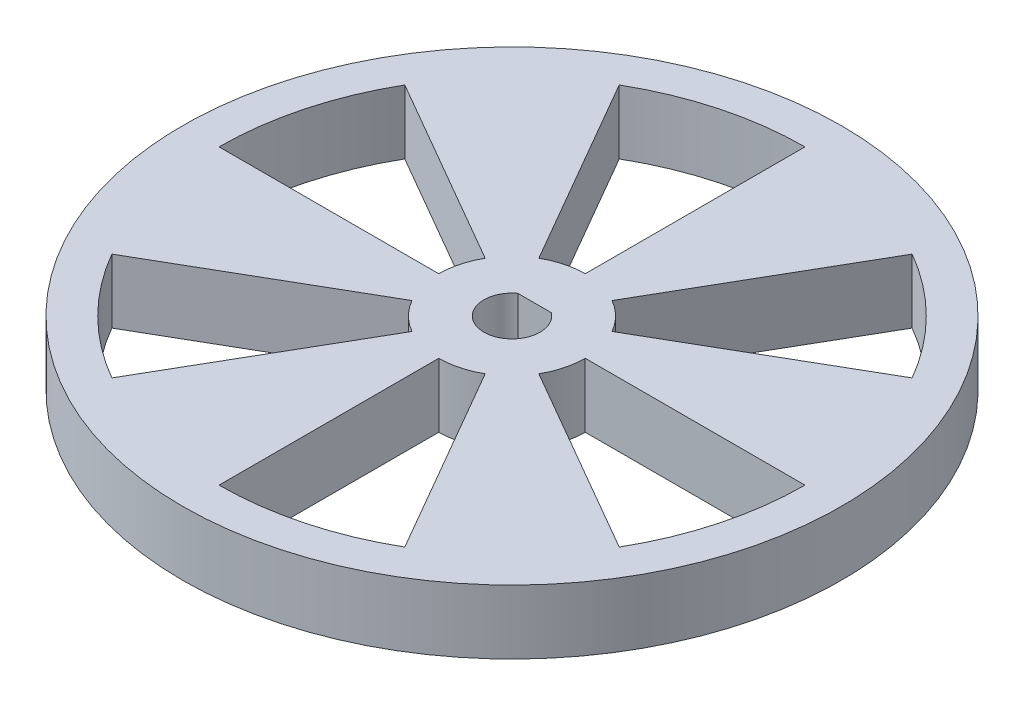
ISO-10303-21;
HEADER;
FILE_DESCRIPTION(('STEP AP214'),'2;1');
FILE_NAME('part.step','',(''),(''),'','','');
FILE_SCHEMA(('AUTOMOTIVE_DESIGN { 1 0 10303 214 1 1 1 1 }'));
ENDSEC;
DATA;
#1=APPLICATION_CONTEXT('core data for automotive mechanical design processes');
#2=APPLICATION_PROTOCOL_DEFINITION('international standard','automotive_design',2000,#1);
#3=PRODUCT_CONTEXT('',#1,'mechanical');
#4=PRODUCT('Part','Part','',(#3));
#5=PRODUCT_RELATED_PRODUCT_CATEGORY('part','',(#4));
#6=PRODUCT_DEFINITION_FORMATION('','',#4);
#7=PRODUCT_DEFINITION_CONTEXT('part definition',#1,'design');
#8=PRODUCT_DEFINITION('design','',#6,#7);
#9=PRODUCT_DEFINITION_SHAPE('','',#8);
#10=(LENGTH_UNIT() NAMED_UNIT(*) SI_UNIT(.MILLI.,.METRE.));
#11=(NAMED_UNIT(*) PLANE_ANGLE_UNIT() SI_UNIT($,.RADIAN.));
#12=(NAMED_UNIT(*) SI_UNIT($,.STERADIAN.) SOLID_ANGLE_UNIT());
#13=UNCERTAINTY_MEASURE_WITH_UNIT(LENGTH_MEASURE(1.E-05),#10,'distance_accuracy_value','');
#14=(GEOMETRIC_REPRESENTATION_CONTEXT(3) GLOBAL_UNCERTAINTY_ASSIGNED_CONTEXT((#13)) GLOBAL_UNIT_ASSIGNED_CONTEXT((#10,
#11,#12)) REPRESENTATION_CONTEXT('',''));
#15=CARTESIAN_POINT('',(0.,0.,0.));
#16=DIRECTION('',(0.,0.,1.));
#17=DIRECTION('',(1.,0.,0.));
#18=AXIS2_PLACEMENT_3D('',#15,#16,#17);
#19=CARTESIAN_POINT('',(0.,7.,0.));
#20=DIRECTION('',(0.,1.,0.));
#21=DIRECTION('',(0.,0.,1.));
#22=AXIS2_PLACEMENT_3D('',#19,#20,#21);
#23=PLANE('',#22);
#24=DIRECTION('',(-0.499999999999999,0.,0.866025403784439));
#25=VECTOR('',#24,1.);
#26=CARTESIAN_POINT('',(4.,7.,-6.92820323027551));
#27=LINE('',#26,#25);
#28=CARTESIAN_POINT('',(16.,7.,-27.712812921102));
#29=VERTEX_POINT('',#28);
#30=CARTESIAN_POINT('',(4.,7.,-6.92820323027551));
#31=VERTEX_POINT('',#30);
#32=EDGE_CURVE('E242',#29,#31,#27,.T.);
#33=ORIENTED_EDGE('',*,*,#32,.F.);
#34=CARTESIAN_POINT('',(0.,7.,0.));
#35=DIRECTION('',(0.,1.,0.));
#36=DIRECTION('',(0.,0.,1.));
#37=AXIS2_PLACEMENT_3D('',#34,#35,#36);
#38=CIRCLE('',#37,32.);
#39=CARTESIAN_POINT('',(27.712812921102,7.,-16.));
#40=VERTEX_POINT('',#39);
#41=EDGE_CURVE('E240',#40,#29,#38,.T.);
#42=ORIENTED_EDGE('',*,*,#41,.F.);
#43=DIRECTION('',(0.866025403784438,0.,-0.500000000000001));
#44=VECTOR('',#43,1.);
#45=CARTESIAN_POINT('',(6.92820323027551,7.,-4.));
#46=LINE('',#45,#44);
#47=CARTESIAN_POINT('',(6.92820323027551,7.,-4.00000000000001));
#48=VERTEX_POINT('',#47);
#49=EDGE_CURVE('E248',#48,#40,#46,.T.);
#50=ORIENTED_EDGE('',*,*,#49,.F.);
#51=CARTESIAN_POINT('',(0.,7.,0.));
#52=DIRECTION('',(0.,-1.,0.));
#53=DIRECTION('',(0.,0.,1.));
#54=AXIS2_PLACEMENT_3D('',#51,#52,#53);
#55=CIRCLE('',#54,8.);
#56=EDGE_CURVE('E245',#31,#48,#55,.T.);
#57=ORIENTED_EDGE('',*,*,#56,.F.);
#58=EDGE_LOOP('',(#33,#42,#50,#57));
#59=FACE_BOUND('',#58,.T.);
#60=DIRECTION('',(-1.,0.,0.));
#61=VECTOR('',#60,1.);
#62=CARTESIAN_POINT('',(1.83187666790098,7.,-2.46356));
#63=LINE('',#62,#61);
#64=CARTESIAN_POINT('',(1.83187666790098,7.,-2.46356));
#65=VERTEX_POINT('',#64);
#66=CARTESIAN_POINT('',(-1.83187666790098,7.,-2.46356));
#67=VERTEX_POINT('',#66);
#68=EDGE_CURVE('E305',#65,#67,#63,.T.);
#69=ORIENTED_EDGE('',*,*,#68,.F.);
#70=CARTESIAN_POINT('',(0.,7.,0.));
#71=DIRECTION('',(0.,1.,0.));
#72=DIRECTION('',(0.,0.,1.));
#73=AXIS2_PLACEMENT_3D('',#70,#71,#72);
#74=CIRCLE('',#73,3.07);
#75=EDGE_CURVE('E302',#67,#65,#74,.T.);
#76=ORIENTED_EDGE('',*,*,#75,.F.);
#77=EDGE_LOOP('',(#69,#76));
#78=FACE_BOUND('',#77,.T.);
#79=DIRECTION('',(0.5,0.,0.866025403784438));
#80=VECTOR('',#79,1.);
#81=CARTESIAN_POINT('',(-4.00000000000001,7.,-6.92820323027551));
#82=LINE('',#81,#80);
#83=CARTESIAN_POINT('',(-16.,7.,-27.712812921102));
#84=VERTEX_POINT('',#83);
#85=CARTESIAN_POINT('',(-4.00000000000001,7.,-6.92820323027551));
#86=VERTEX_POINT('',#85);
#87=EDGE_CURVE('E352',#84,#86,#82,.T.);
#88=ORIENTED_EDGE('',*,*,#87,.F.);
#89=CARTESIAN_POINT('',(0.,7.,0.));
#90=DIRECTION('',(0.,1.,0.));
#91=DIRECTION('',(0.,0.,1.));
#92=AXIS2_PLACEMENT_3D('',#89,#90,#91);
#93=CIRCLE('',#92,32.);
#94=CARTESIAN_POINT('',(2.23523435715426E-13,7.,-32.));
#95=VERTEX_POINT('',#94);
#96=EDGE_CURVE('E350',#95,#84,#93,.T.);
#97=ORIENTED_EDGE('',*,*,#96,.F.);
#98=DIRECTION('',(0.,0.,-1.));
#99=VECTOR('',#98,1.);
#100=CARTESIAN_POINT('',(0.,7.,-8.));
#101=LINE('',#100,#99);
#102=CARTESIAN_POINT('',(0.,7.,-8.));
#103=VERTEX_POINT('',#102);
#104=EDGE_CURVE('E358',#103,#95,#101,.T.);
#105=ORIENTED_EDGE('',*,*,#104,.F.);
#106=CARTESIAN_POINT('',(0.,7.,0.));
#107=DIRECTION('',(0.,-1.,0.));
#108=DIRECTION('',(0.,0.,1.));
#109=AXIS2_PLACEMENT_3D('',#106,#107,#108);
#110=CIRCLE('',#109,8.);
#111=EDGE_CURVE('E355',#86,#103,#110,.T.);
#112=ORIENTED_EDGE('',*,*,#111,.F.);
#113=EDGE_LOOP('',(#88,#97,#105,#112));
#114=FACE_BOUND('',#113,.T.);
#115=CARTESIAN_POINT('',(0.,7.,0.));
#116=DIRECTION('',(0.,1.,0.));
#117=DIRECTION('',(0.,0.,1.));
#118=AXIS2_PLACEMENT_3D('',#115,#116,#117);
#119=CIRCLE('',#118,36.);
#120=CARTESIAN_POINT('',(0.,7.,36.));
#121=VERTEX_POINT('',#120);
#122=EDGE_CURVE('E11',#121,#121,#119,.T.);
#123=ORIENTED_EDGE('',*,*,#122,.T.);
#124=EDGE_LOOP('',(#123));
#125=FACE_BOUND('',#124,.T.);
#126=DIRECTION('',(-0.866025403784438,0.,0.5));
#127=VECTOR('',#126,1.);
#128=CARTESIAN_POINT('',(-6.92820323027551,7.,4.00000000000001));
#129=LINE('',#128,#127);
#130=CARTESIAN_POINT('',(-6.92820323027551,7.,4.00000000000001));
#131=VERTEX_POINT('',#130);
#132=CARTESIAN_POINT('',(-27.712812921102,7.,16.));
#133=VERTEX_POINT('',#132);
#134=EDGE_CURVE('E383',#131,#133,#129,.T.);
#135=ORIENTED_EDGE('',*,*,#134,.F.);
#136=CARTESIAN_POINT('',(0.,7.,0.));
#137=DIRECTION('',(0.,-1.,0.));
#138=DIRECTION('',(0.,0.,1.));
#139=AXIS2_PLACEMENT_3D('',#136,#137,#138);
#140=CIRCLE('',#139,8.);
#141=CARTESIAN_POINT('',(-4.,7.,6.92820323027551));
#142=VERTEX_POINT('',#141);
#143=EDGE_CURVE('E381',#142,#131,#140,.T.);
#144=ORIENTED_EDGE('',*,*,#143,.F.);
#145=DIRECTION('',(0.5,0.,-0.866025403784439));
#146=VECTOR('',#145,1.);
#147=CARTESIAN_POINT('',(-4.,7.,6.92820323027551));
#148=LINE('',#147,#146);
#149=CARTESIAN_POINT('',(-16.,7.,27.712812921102));
#150=VERTEX_POINT('',#149);
#151=EDGE_CURVE('E389',#150,#142,#148,.T.);
#152=ORIENTED_EDGE('',*,*,#151,.F.);
#153=CARTESIAN_POINT('',(0.,7.,0.));
#154=DIRECTION('',(0.,1.,0.));
#155=DIRECTION('',(0.,0.,1.));
#156=AXIS2_PLACEMENT_3D('',#153,#154,#155);
#157=CIRCLE('',#156,32.);
#158=EDGE_CURVE('E386',#133,#150,#157,.T.);
#159=ORIENTED_EDGE('',*,*,#158,.F.);
#160=EDGE_LOOP('',(#135,#144,#152,#159));
#161=FACE_BOUND('',#160,.T.);
#162=DIRECTION('',(-0.5,0.,-0.866025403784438));
#163=VECTOR('',#162,1.);
#164=CARTESIAN_POINT('',(4.,7.,6.92820323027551));
#165=LINE('',#164,#163);
#166=CARTESIAN_POINT('',(16.,7.,27.712812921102));
#167=VERTEX_POINT('',#166);
#168=CARTESIAN_POINT('',(4.,7.,6.92820323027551));
#169=VERTEX_POINT('',#168);
#170=EDGE_CURVE('E321',#167,#169,#165,.T.);
#171=ORIENTED_EDGE('',*,*,#170,.F.);
#172=CARTESIAN_POINT('',(0.,7.,0.));
#173=DIRECTION('',(0.,1.,0.));
#174=DIRECTION('',(0.,0.,1.));
#175=AXIS2_PLACEMENT_3D('',#172,#173,#174);
#176=CIRCLE('',#175,32.);
#177=CARTESIAN_POINT('',(0.,7.,32.));
#178=VERTEX_POINT('',#177);
#179=EDGE_CURVE('E319',#178,#167,#176,.T.);
#180=ORIENTED_EDGE('',*,*,#179,.F.);
#181=DIRECTION('',(0.,0.,1.));
#182=VECTOR('',#181,1.);
#183=CARTESIAN_POINT('',(0.,7.,8.));
#184=LINE('',#183,#182);
#185=CARTESIAN_POINT('',(0.,7.,8.));
#186=VERTEX_POINT('',#185);
#187=EDGE_CURVE('E327',#186,#178,#184,.T.);
#188=ORIENTED_EDGE('',*,*,#187,.F.);
#189=CARTESIAN_POINT('',(0.,7.,0.));
#190=DIRECTION('',(0.,-1.,0.));
#191=DIRECTION('',(0.,0.,1.));
#192=AXIS2_PLACEMENT_3D('',#189,#190,#191);
#193=CIRCLE('',#192,8.);
#194=EDGE_CURVE('E324',#169,#186,#193,.T.);
#195=ORIENTED_EDGE('',*,*,#194,.F.);
#196=EDGE_LOOP('',(#171,#180,#188,#195));
#197=FACE_BOUND('',#196,.T.);
#198=DIRECTION('',(1.,0.,0.));
#199=VECTOR('',#198,1.);
#200=CARTESIAN_POINT('',(-8.,7.,0.));
#201=LINE('',#200,#199);
#202=CARTESIAN_POINT('',(-32.,7.,-1.11795968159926E-13));
#203=VERTEX_POINT('',#202);
#204=CARTESIAN_POINT('',(-8.,7.,0.));
#205=VERTEX_POINT('',#204);
#206=EDGE_CURVE('E273',#203,#205,#201,.T.);
#207=ORIENTED_EDGE('',*,*,#206,.F.);
#208=CARTESIAN_POINT('',(0.,7.,0.));
#209=DIRECTION('',(0.,1.,0.));
#210=DIRECTION('',(0.,0.,1.));
#211=AXIS2_PLACEMENT_3D('',#208,#209,#210);
#212=CIRCLE('',#211,32.);
#213=CARTESIAN_POINT('',(-27.712812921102,7.,-16.));
#214=VERTEX_POINT('',#213);
#215=EDGE_CURVE('E271',#214,#203,#212,.T.);
#216=ORIENTED_EDGE('',*,*,#215,.F.);
#217=DIRECTION('',(-0.866025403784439,0.,-0.499999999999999));
#218=VECTOR('',#217,1.);
#219=CARTESIAN_POINT('',(-6.92820323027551,7.,-3.99999999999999));
#220=LINE('',#219,#218);
#221=CARTESIAN_POINT('',(-6.92820323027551,7.,-3.99999999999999));
#222=VERTEX_POINT('',#221);
#223=EDGE_CURVE('E279',#222,#214,#220,.T.);
#224=ORIENTED_EDGE('',*,*,#223,.F.);
#225=CARTESIAN_POINT('',(0.,7.,0.));
#226=DIRECTION('',(0.,-1.,0.));
#227=DIRECTION('',(0.,0.,1.));
#228=AXIS2_PLACEMENT_3D('',#225,#226,#227);
#229=CIRCLE('',#228,8.);
#230=EDGE_CURVE('E276',#205,#222,#229,.T.);
#231=ORIENTED_EDGE('',*,*,#230,.F.);
#232=EDGE_LOOP('',(#207,#216,#224,#231));
#233=FACE_BOUND('',#232,.T.);
#234=DIRECTION('',(0.866025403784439,0.,0.5));
#235=VECTOR('',#234,1.);
#236=CARTESIAN_POINT('',(6.92820323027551,7.,4.));
#237=LINE('',#236,#235);
#238=CARTESIAN_POINT('',(6.92820323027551,7.,4.));
#239=VERTEX_POINT('',#238);
#240=CARTESIAN_POINT('',(27.712812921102,7.,16.));
#241=VERTEX_POINT('',#240);
#242=EDGE_CURVE('E212',#239,#241,#237,.T.);
#243=ORIENTED_EDGE('',*,*,#242,.F.);
#244=CARTESIAN_POINT('',(0.,7.,0.));
#245=DIRECTION('',(0.,-1.,0.));
#246=DIRECTION('',(0.,0.,1.));
#247=AXIS2_PLACEMENT_3D('',#244,#245,#246);
#248=CIRCLE('',#247,8.);
#249=CARTESIAN_POINT('',(8.,7.,0.));
#250=VERTEX_POINT('',#249);
#251=EDGE_CURVE('E204',#250,#239,#248,.T.);
#252=ORIENTED_EDGE('',*,*,#251,.F.);
#253=DIRECTION('',(-1.,0.,0.));
#254=VECTOR('',#253,1.);
#255=CARTESIAN_POINT('',(8.,7.,0.));
#256=LINE('',#255,#254);
#257=CARTESIAN_POINT('',(32.,7.,3.35250903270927E-13));
#258=VERTEX_POINT('',#257);
#259=EDGE_CURVE('E226',#258,#250,#256,.T.);
#260=ORIENTED_EDGE('',*,*,#259,.F.);
#261=CARTESIAN_POINT('',(0.,7.,0.));
#262=DIRECTION('',(0.,1.,0.));
#263=DIRECTION('',(0.,0.,1.));
#264=AXIS2_PLACEMENT_3D('',#261,#262,#263);
#265=CIRCLE('',#264,32.);
#266=EDGE_CURVE('E224',#241,#258,#265,.T.);
#267=ORIENTED_EDGE('',*,*,#266,.F.);
#268=EDGE_LOOP('',(#243,#252,#260,#267));
#269=FACE_BOUND('',#268,.T.);
#270=ADVANCED_FACE('F31',(#59,#78,#114,#125,#161,#197,#233,#269),#23,.T.);
#271=CARTESIAN_POINT('',(0.,0.,0.));
#272=DIRECTION('',(0.,1.,0.));
#273=DIRECTION('',(0.,0.,1.));
#274=AXIS2_PLACEMENT_3D('',#271,#272,#273);
#275=PLANE('',#274);
#276=CARTESIAN_POINT('',(0.,0.,0.));
#277=DIRECTION('',(0.,1.,0.));
#278=DIRECTION('',(0.,0.,1.));
#279=AXIS2_PLACEMENT_3D('',#276,#277,#278);
#280=CIRCLE('',#279,32.);
#281=CARTESIAN_POINT('',(27.712812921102,0.,-16.));
#282=VERTEX_POINT('',#281);
#283=CARTESIAN_POINT('',(16.,0.,-27.712812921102));
#284=VERTEX_POINT('',#283);
#285=EDGE_CURVE('E220',#282,#284,#280,.T.);
#286=ORIENTED_EDGE('',*,*,#285,.T.);
#287=DIRECTION('',(-0.499999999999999,0.,0.866025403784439));
#288=VECTOR('',#287,1.);
#289=CARTESIAN_POINT('',(4.,0.,-6.92820323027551));
#290=LINE('',#289,#288);
#291=CARTESIAN_POINT('',(4.,0.,-6.92820323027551));
#292=VERTEX_POINT('',#291);
#293=EDGE_CURVE('E253',#284,#292,#290,.T.);
#294=ORIENTED_EDGE('',*,*,#293,.T.);
#295=CARTESIAN_POINT('',(0.,0.,0.));
#296=DIRECTION('',(0.,-1.,0.));
#297=DIRECTION('',(0.,0.,1.));
#298=AXIS2_PLACEMENT_3D('',#295,#296,#297);
#299=CIRCLE('',#298,8.);
#300=CARTESIAN_POINT('',(6.92820323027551,0.,-4.));
#301=VERTEX_POINT('',#300);
#302=EDGE_CURVE('E256',#292,#301,#299,.T.);
#303=ORIENTED_EDGE('',*,*,#302,.T.);
#304=DIRECTION('',(0.866025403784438,0.,-0.500000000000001));
#305=VECTOR('',#304,1.);
#306=CARTESIAN_POINT('',(6.92820323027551,0.,-4.));
#307=LINE('',#306,#305);
#308=EDGE_CURVE('E243',#301,#282,#307,.T.);
#309=ORIENTED_EDGE('',*,*,#308,.T.);
#310=EDGE_LOOP('',(#286,#294,#303,#309));
#311=FACE_BOUND('',#310,.T.);
#312=CARTESIAN_POINT('',(0.,0.,0.));
#313=DIRECTION('',(0.,1.,0.));
#314=DIRECTION('',(0.,0.,1.));
#315=AXIS2_PLACEMENT_3D('',#312,#313,#314);
#316=CIRCLE('',#315,3.07);
#317=CARTESIAN_POINT('',(-1.83187666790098,0.,-2.46356));
#318=VERTEX_POINT('',#317);
#319=CARTESIAN_POINT('',(1.83187666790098,0.,-2.46356));
#320=VERTEX_POINT('',#319);
#321=EDGE_CURVE('E301',#318,#320,#316,.T.);
#322=ORIENTED_EDGE('',*,*,#321,.T.);
#323=DIRECTION('',(-1.,0.,0.));
#324=VECTOR('',#323,1.);
#325=CARTESIAN_POINT('',(1.83187666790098,0.,-2.46356));
#326=LINE('',#325,#324);
#327=EDGE_CURVE('E306',#320,#318,#326,.T.);
#328=ORIENTED_EDGE('',*,*,#327,.T.);
#329=EDGE_LOOP('',(#322,#328));
#330=FACE_BOUND('',#329,.T.);
#331=CARTESIAN_POINT('',(0.,0.,0.));
#332=DIRECTION('',(0.,1.,0.));
#333=DIRECTION('',(0.,0.,1.));
#334=AXIS2_PLACEMENT_3D('',#331,#332,#333);
#335=CIRCLE('',#334,32.);
#336=CARTESIAN_POINT('',(2.23523435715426E-13,0.,-32.));
#337=VERTEX_POINT('',#336);
#338=CARTESIAN_POINT('',(-16.,0.,-27.712812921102));
#339=VERTEX_POINT('',#338);
#340=EDGE_CURVE('E349',#337,#339,#335,.T.);
#341=ORIENTED_EDGE('',*,*,#340,.T.);
#342=DIRECTION('',(0.5,0.,0.866025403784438));
#343=VECTOR('',#342,1.);
#344=CARTESIAN_POINT('',(-4.00000000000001,0.,-6.92820323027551));
#345=LINE('',#344,#343);
#346=CARTESIAN_POINT('',(-4.00000000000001,0.,-6.92820323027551));
#347=VERTEX_POINT('',#346);
#348=EDGE_CURVE('E363',#339,#347,#345,.T.);
#349=ORIENTED_EDGE('',*,*,#348,.T.);
#350=CARTESIAN_POINT('',(0.,0.,0.));
#351=DIRECTION('',(0.,-1.,0.));
#352=DIRECTION('',(0.,0.,1.));
#353=AXIS2_PLACEMENT_3D('',#350,#351,#352);
#354=CIRCLE('',#353,8.);
#355=CARTESIAN_POINT('',(0.,0.,-8.));
#356=VERTEX_POINT('',#355);
#357=EDGE_CURVE('E366',#347,#356,#354,.T.);
#358=ORIENTED_EDGE('',*,*,#357,.T.);
#359=DIRECTION('',(0.,0.,-1.));
#360=VECTOR('',#359,1.);
#361=CARTESIAN_POINT('',(0.,0.,-8.));
#362=LINE('',#361,#360);
#363=EDGE_CURVE('E353',#356,#337,#362,.T.);
#364=ORIENTED_EDGE('',*,*,#363,.T.);
#365=EDGE_LOOP('',(#341,#349,#358,#364));
#366=FACE_BOUND('',#365,.T.);
#367=CARTESIAN_POINT('',(0.,0.,0.));
#368=DIRECTION('',(0.,1.,0.));
#369=DIRECTION('',(0.,0.,1.));
#370=AXIS2_PLACEMENT_3D('',#367,#368,#369);
#371=CIRCLE('',#370,36.);
#372=CARTESIAN_POINT('',(0.,0.,36.));
#373=VERTEX_POINT('',#372);
#374=EDGE_CURVE('E35',#373,#373,#371,.T.);
#375=ORIENTED_EDGE('',*,*,#374,.F.);
#376=EDGE_LOOP('',(#375));
#377=FACE_BOUND('',#376,.T.);
#378=CARTESIAN_POINT('',(0.,0.,0.));
#379=DIRECTION('',(0.,-1.,0.));
#380=DIRECTION('',(0.,0.,1.));
#381=AXIS2_PLACEMENT_3D('',#378,#379,#380);
#382=CIRCLE('',#381,8.);
#383=CARTESIAN_POINT('',(-4.,0.,6.92820323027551));
#384=VERTEX_POINT('',#383);
#385=CARTESIAN_POINT('',(-6.92820323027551,0.,4.00000000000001));
#386=VERTEX_POINT('',#385);
#387=EDGE_CURVE('E380',#384,#386,#382,.T.);
#388=ORIENTED_EDGE('',*,*,#387,.T.);
#389=DIRECTION('',(-0.866025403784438,0.,0.5));
#390=VECTOR('',#389,1.);
#391=CARTESIAN_POINT('',(-6.92820323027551,0.,4.00000000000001));
#392=LINE('',#391,#390);
#393=CARTESIAN_POINT('',(-27.712812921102,0.,16.));
#394=VERTEX_POINT('',#393);
#395=EDGE_CURVE('E394',#386,#394,#392,.T.);
#396=ORIENTED_EDGE('',*,*,#395,.T.);
#397=CARTESIAN_POINT('',(0.,0.,0.));
#398=DIRECTION('',(0.,1.,0.));
#399=DIRECTION('',(0.,0.,1.));
#400=AXIS2_PLACEMENT_3D('',#397,#398,#399);
#401=CIRCLE('',#400,32.);
#402=CARTESIAN_POINT('',(-16.,0.,27.712812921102));
#403=VERTEX_POINT('',#402);
#404=EDGE_CURVE('E397',#394,#403,#401,.T.);
#405=ORIENTED_EDGE('',*,*,#404,.T.);
#406=DIRECTION('',(0.5,0.,-0.866025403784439));
#407=VECTOR('',#406,1.);
#408=CARTESIAN_POINT('',(-4.,0.,6.92820323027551));
#409=LINE('',#408,#407);
#410=EDGE_CURVE('E384',#403,#384,#409,.T.);
#411=ORIENTED_EDGE('',*,*,#410,.T.);
#412=EDGE_LOOP('',(#388,#396,#405,#411));
#413=FACE_BOUND('',#412,.T.);
#414=CARTESIAN_POINT('',(0.,0.,0.));
#415=DIRECTION('',(0.,1.,0.));
#416=DIRECTION('',(0.,0.,1.));
#417=AXIS2_PLACEMENT_3D('',#414,#415,#416);
#418=CIRCLE('',#417,32.);
#419=CARTESIAN_POINT('',(0.,0.,32.));
#420=VERTEX_POINT('',#419);
#421=CARTESIAN_POINT('',(16.,0.,27.712812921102));
#422=VERTEX_POINT('',#421);
#423=EDGE_CURVE('E318',#420,#422,#418,.T.);
#424=ORIENTED_EDGE('',*,*,#423,.T.);
#425=DIRECTION('',(-0.5,0.,-0.866025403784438));
#426=VECTOR('',#425,1.);
#427=CARTESIAN_POINT('',(4.,0.,6.92820323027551));
#428=LINE('',#427,#426);
#429=CARTESIAN_POINT('',(4.,0.,6.92820323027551));
#430=VERTEX_POINT('',#429);
#431=EDGE_CURVE('E332',#422,#430,#428,.T.);
#432=ORIENTED_EDGE('',*,*,#431,.T.);
#433=CARTESIAN_POINT('',(0.,0.,0.));
#434=DIRECTION('',(0.,-1.,0.));
#435=DIRECTION('',(0.,0.,1.));
#436=AXIS2_PLACEMENT_3D('',#433,#434,#435);
#437=CIRCLE('',#436,8.);
#438=CARTESIAN_POINT('',(0.,0.,8.));
#439=VERTEX_POINT('',#438);
#440=EDGE_CURVE('E335',#430,#439,#437,.T.);
#441=ORIENTED_EDGE('',*,*,#440,.T.);
#442=DIRECTION('',(0.,0.,1.));
#443=VECTOR('',#442,1.);
#444=CARTESIAN_POINT('',(0.,0.,8.));
#445=LINE('',#444,#443);
#446=EDGE_CURVE('E322',#439,#420,#445,.T.);
#447=ORIENTED_EDGE('',*,*,#446,.T.);
#448=EDGE_LOOP('',(#424,#432,#441,#447));
#449=FACE_BOUND('',#448,.T.);
#450=CARTESIAN_POINT('',(0.,0.,0.));
#451=DIRECTION('',(0.,1.,0.));
#452=DIRECTION('',(0.,0.,1.));
#453=AXIS2_PLACEMENT_3D('',#450,#451,#452);
#454=CIRCLE('',#453,32.);
#455=CARTESIAN_POINT('',(-27.712812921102,0.,-16.));
#456=VERTEX_POINT('',#455);
#457=CARTESIAN_POINT('',(-32.,0.,-1.11795968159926E-13));
#458=VERTEX_POINT('',#457);
#459=EDGE_CURVE('E270',#456,#458,#454,.T.);
#460=ORIENTED_EDGE('',*,*,#459,.T.);
#461=DIRECTION('',(1.,0.,0.));
#462=VECTOR('',#461,1.);
#463=CARTESIAN_POINT('',(-8.,0.,0.));
#464=LINE('',#463,#462);
#465=CARTESIAN_POINT('',(-8.,0.,0.));
#466=VERTEX_POINT('',#465);
#467=EDGE_CURVE('E284',#458,#466,#464,.T.);
#468=ORIENTED_EDGE('',*,*,#467,.T.);
#469=CARTESIAN_POINT('',(0.,0.,0.));
#470=DIRECTION('',(0.,-1.,0.));
#471=DIRECTION('',(0.,0.,1.));
#472=AXIS2_PLACEMENT_3D('',#469,#470,#471);
#473=CIRCLE('',#472,8.);
#474=CARTESIAN_POINT('',(-6.92820323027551,0.,-3.99999999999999));
#475=VERTEX_POINT('',#474);
#476=EDGE_CURVE('E287',#466,#475,#473,.T.);
#477=ORIENTED_EDGE('',*,*,#476,.T.);
#478=DIRECTION('',(-0.866025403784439,0.,-0.499999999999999));
#479=VECTOR('',#478,1.);
#480=CARTESIAN_POINT('',(-6.92820323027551,0.,-3.99999999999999));
#481=LINE('',#480,#479);
#482=EDGE_CURVE('E274',#475,#456,#481,.T.);
#483=ORIENTED_EDGE('',*,*,#482,.T.);
#484=EDGE_LOOP('',(#460,#468,#477,#483));
#485=FACE_BOUND('',#484,.T.);
#486=CARTESIAN_POINT('',(0.,0.,0.));
#487=DIRECTION('',(0.,-1.,0.));
#488=DIRECTION('',(0.,0.,1.));
#489=AXIS2_PLACEMENT_3D('',#486,#487,#488);
#490=CIRCLE('',#489,8.);
#491=CARTESIAN_POINT('',(8.,0.,0.));
#492=VERTEX_POINT('',#491);
#493=CARTESIAN_POINT('',(6.92820323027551,0.,4.));
#494=VERTEX_POINT('',#493);
#495=EDGE_CURVE('E54',#492,#494,#490,.T.);
#496=ORIENTED_EDGE('',*,*,#495,.T.);
#497=DIRECTION('',(0.866025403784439,0.,0.5));
#498=VECTOR('',#497,1.);
#499=CARTESIAN_POINT('',(6.92820323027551,0.,4.));
#500=LINE('',#499,#498);
#501=CARTESIAN_POINT('',(27.712812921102,0.,16.));
#502=VERTEX_POINT('',#501);
#503=EDGE_CURVE('E219',#494,#502,#500,.T.);
#504=ORIENTED_EDGE('',*,*,#503,.T.);
#505=CARTESIAN_POINT('',(0.,0.,0.));
#506=DIRECTION('',(0.,1.,0.));
#507=DIRECTION('',(0.,0.,1.));
#508=AXIS2_PLACEMENT_3D('',#505,#506,#507);
#509=CIRCLE('',#508,32.);
#510=CARTESIAN_POINT('',(32.,0.,3.35250903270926E-13));
#511=VERTEX_POINT('',#510);
#512=EDGE_CURVE('E232',#502,#511,#509,.T.);
#513=ORIENTED_EDGE('',*,*,#512,.T.);
#514=DIRECTION('',(-1.,0.,0.));
#515=VECTOR('',#514,1.);
#516=CARTESIAN_POINT('',(8.,0.,0.));
#517=LINE('',#516,#515);
#518=EDGE_CURVE('E213',#511,#492,#517,.T.);
#519=ORIENTED_EDGE('',*,*,#518,.T.);
#520=EDGE_LOOP('',(#496,#504,#513,#519));
#521=FACE_BOUND('',#520,.T.);
#522=ADVANCED_FACE('F416',(#311,#330,#366,#377,#413,#449,#485,#521),#275,.F.);
#523=CARTESIAN_POINT('',(0.,7.,0.));
#524=DIRECTION('',(0.,-1.,0.));
#525=DIRECTION('',(0.,0.,-1.));
#526=AXIS2_PLACEMENT_3D('',#523,#524,#525);
#527=CYLINDRICAL_SURFACE('',#526,36.);
#528=ORIENTED_EDGE('',*,*,#122,.F.);
#529=EDGE_LOOP('',(#528));
#530=FACE_BOUND('',#529,.T.);
#531=ORIENTED_EDGE('',*,*,#374,.T.);
#532=EDGE_LOOP('',(#531));
#533=FACE_BOUND('',#532,.T.);
#534=ADVANCED_FACE('F33',(#530,#533),#527,.T.);
#535=CARTESIAN_POINT('',(0.,7.,0.));
#536=DIRECTION('',(0.,-1.,0.));
#537=DIRECTION('',(0.,0.,-1.));
#538=AXIS2_PLACEMENT_3D('',#535,#536,#537);
#539=CYLINDRICAL_SURFACE('',#538,8.);
#540=ORIENTED_EDGE('',*,*,#387,.F.);
#541=DIRECTION('',(0.,-1.,0.));
#542=VECTOR('',#541,1.);
#543=CARTESIAN_POINT('',(-4.,7.,6.92820323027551));
#544=LINE('',#543,#542);
#545=EDGE_CURVE('E391',#142,#384,#544,.T.);
#546=ORIENTED_EDGE('',*,*,#545,.F.);
#547=ORIENTED_EDGE('',*,*,#143,.T.);
#548=DIRECTION('',(0.,-1.,0.));
#549=VECTOR('',#548,1.);
#550=CARTESIAN_POINT('',(-6.92820323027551,7.,4.00000000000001));
#551=LINE('',#550,#549);
#552=EDGE_CURVE('E408',#131,#386,#551,.T.);
#553=ORIENTED_EDGE('',*,*,#552,.T.);
#554=EDGE_LOOP('',(#540,#546,#547,#553));
#555=FACE_BOUND('',#554,.T.);
#556=ADVANCED_FACE('F441',(#555),#539,.T.);
#557=CARTESIAN_POINT('',(-6.92820323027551,7.,4.00000000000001));
#558=DIRECTION('',(0.5,0.,0.866025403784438));
#559=DIRECTION('',(0.866025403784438,0.,-0.5));
#560=AXIS2_PLACEMENT_3D('',#557,#558,#559);
#561=PLANE('',#560);
#562=ORIENTED_EDGE('',*,*,#395,.F.);
#563=ORIENTED_EDGE('',*,*,#552,.F.);
#564=ORIENTED_EDGE('',*,*,#134,.T.);
#565=DIRECTION('',(0.,-1.,0.));
#566=VECTOR('',#565,1.);
#567=CARTESIAN_POINT('',(-27.712812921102,7.,16.));
#568=LINE('',#567,#566);
#569=EDGE_CURVE('E406',#133,#394,#568,.T.);
#570=ORIENTED_EDGE('',*,*,#569,.T.);
#571=EDGE_LOOP('',(#562,#563,#564,#570));
#572=FACE_BOUND('',#571,.T.);
#573=ADVANCED_FACE('F444',(#572),#561,.T.);
#574=CARTESIAN_POINT('',(0.,7.,0.));
#575=DIRECTION('',(0.,-1.,0.));
#576=DIRECTION('',(0.,0.,-1.));
#577=AXIS2_PLACEMENT_3D('',#574,#575,#576);
#578=CYLINDRICAL_SURFACE('',#577,32.);
#579=ORIENTED_EDGE('',*,*,#404,.F.);
#580=ORIENTED_EDGE('',*,*,#569,.F.);
#581=ORIENTED_EDGE('',*,*,#158,.T.);
#582=DIRECTION('',(0.,-1.,0.));
#583=VECTOR('',#582,1.);
#584=CARTESIAN_POINT('',(-16.,7.,27.712812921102));
#585=LINE('',#584,#583);
#586=EDGE_CURVE('E404',#150,#403,#585,.T.);
#587=ORIENTED_EDGE('',*,*,#586,.T.);
#588=EDGE_LOOP('',(#579,#580,#581,#587));
#589=FACE_BOUND('',#588,.T.);
#590=ADVANCED_FACE('F447',(#589),#578,.F.);
#591=CARTESIAN_POINT('',(-4.,7.,6.92820323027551));
#592=DIRECTION('',(-0.866025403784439,0.,-0.5));
#593=DIRECTION('',(-0.5,0.,0.866025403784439));
#594=AXIS2_PLACEMENT_3D('',#591,#592,#593);
#595=PLANE('',#594);
#596=ORIENTED_EDGE('',*,*,#410,.F.);
#597=ORIENTED_EDGE('',*,*,#586,.F.);
#598=ORIENTED_EDGE('',*,*,#151,.T.);
#599=ORIENTED_EDGE('',*,*,#545,.T.);
#600=EDGE_LOOP('',(#596,#597,#598,#599));
#601=FACE_BOUND('',#600,.T.);
#602=ADVANCED_FACE('F451',(#601),#595,.T.);
#603=CARTESIAN_POINT('',(0.,7.,0.));
#604=DIRECTION('',(0.,-1.,0.));
#605=DIRECTION('',(0.,0.,-1.));
#606=AXIS2_PLACEMENT_3D('',#603,#604,#605);
#607=CYLINDRICAL_SURFACE('',#606,32.);
#608=ORIENTED_EDGE('',*,*,#340,.F.);
#609=DIRECTION('',(0.,-1.,0.));
#610=VECTOR('',#609,1.);
#611=CARTESIAN_POINT('',(2.23523435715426E-13,7.,-32.));
#612=LINE('',#611,#610);
#613=EDGE_CURVE('E360',#95,#337,#612,.T.);
#614=ORIENTED_EDGE('',*,*,#613,.F.);
#615=ORIENTED_EDGE('',*,*,#96,.T.);
#616=DIRECTION('',(0.,-1.,0.));
#617=VECTOR('',#616,1.);
#618=CARTESIAN_POINT('',(-16.,7.,-27.712812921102));
#619=LINE('',#618,#617);
#620=EDGE_CURVE('E377',#84,#339,#619,.T.);
#621=ORIENTED_EDGE('',*,*,#620,.T.);
#622=EDGE_LOOP('',(#608,#614,#615,#621));
#623=FACE_BOUND('',#622,.T.);
#624=ADVANCED_FACE('F455',(#623),#607,.F.);
#625=CARTESIAN_POINT('',(-4.00000000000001,7.,-6.92820323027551));
#626=DIRECTION('',(0.866025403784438,0.,-0.5));
#627=DIRECTION('',(-0.500000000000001,0.,-0.866025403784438));
#628=AXIS2_PLACEMENT_3D('',#625,#626,#627);
#629=PLANE('',#628);
#630=ORIENTED_EDGE('',*,*,#348,.F.);
#631=ORIENTED_EDGE('',*,*,#620,.F.);
#632=ORIENTED_EDGE('',*,*,#87,.T.);
#633=DIRECTION('',(0.,-1.,0.));
#634=VECTOR('',#633,1.);
#635=CARTESIAN_POINT('',(-4.00000000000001,7.,-6.92820323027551));
#636=LINE('',#635,#634);
#637=EDGE_CURVE('E375',#86,#347,#636,.T.);
#638=ORIENTED_EDGE('',*,*,#637,.T.);
#639=EDGE_LOOP('',(#630,#631,#632,#638));
#640=FACE_BOUND('',#639,.T.);
#641=ADVANCED_FACE('F459',(#640),#629,.T.);
#642=CARTESIAN_POINT('',(0.,7.,0.));
#643=DIRECTION('',(0.,-1.,0.));
#644=DIRECTION('',(0.,0.,-1.));
#645=AXIS2_PLACEMENT_3D('',#642,#643,#644);
#646=CYLINDRICAL_SURFACE('',#645,8.);
#647=ORIENTED_EDGE('',*,*,#357,.F.);
#648=ORIENTED_EDGE('',*,*,#637,.F.);
#649=ORIENTED_EDGE('',*,*,#111,.T.);
#650=DIRECTION('',(0.,-1.,0.));
#651=VECTOR('',#650,1.);
#652=CARTESIAN_POINT('',(0.,7.,-8.));
#653=LINE('',#652,#651);
#654=EDGE_CURVE('E373',#103,#356,#653,.T.);
#655=ORIENTED_EDGE('',*,*,#654,.T.);
#656=EDGE_LOOP('',(#647,#648,#649,#655));
#657=FACE_BOUND('',#656,.T.);
#658=ADVANCED_FACE('F463',(#657),#646,.T.);
#659=CARTESIAN_POINT('',(0.,7.,-8.));
#660=DIRECTION('',(-1.,0.,0.));
#661=DIRECTION('',(0.,0.,1.));
#662=AXIS2_PLACEMENT_3D('',#659,#660,#661);
#663=PLANE('',#662);
#664=ORIENTED_EDGE('',*,*,#363,.F.);
#665=ORIENTED_EDGE('',*,*,#654,.F.);
#666=ORIENTED_EDGE('',*,*,#104,.T.);
#667=ORIENTED_EDGE('',*,*,#613,.T.);
#668=EDGE_LOOP('',(#664,#665,#666,#667));
#669=FACE_BOUND('',#668,.T.);
#670=ADVANCED_FACE('F467',(#669),#663,.T.);
#671=CARTESIAN_POINT('',(0.,7.,0.));
#672=DIRECTION('',(0.,-1.,0.));
#673=DIRECTION('',(0.,0.,-1.));
#674=AXIS2_PLACEMENT_3D('',#671,#672,#673);
#675=CYLINDRICAL_SURFACE('',#674,32.);
#676=ORIENTED_EDGE('',*,*,#423,.F.);
#677=DIRECTION('',(0.,-1.,0.));
#678=VECTOR('',#677,1.);
#679=CARTESIAN_POINT('',(0.,7.,32.));
#680=LINE('',#679,#678);
#681=EDGE_CURVE('E329',#178,#420,#680,.T.);
#682=ORIENTED_EDGE('',*,*,#681,.F.);
#683=ORIENTED_EDGE('',*,*,#179,.T.);
#684=DIRECTION('',(0.,-1.,0.));
#685=VECTOR('',#684,1.);
#686=CARTESIAN_POINT('',(16.,7.,27.712812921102));
#687=LINE('',#686,#685);
#688=EDGE_CURVE('E346',#167,#422,#687,.T.);
#689=ORIENTED_EDGE('',*,*,#688,.T.);
#690=EDGE_LOOP('',(#676,#682,#683,#689));
#691=FACE_BOUND('',#690,.T.);
#692=ADVANCED_FACE('F471',(#691),#675,.F.);
#693=CARTESIAN_POINT('',(4.,7.,6.92820323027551));
#694=DIRECTION('',(-0.866025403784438,0.,0.5));
#695=DIRECTION('',(0.5,0.,0.866025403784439));
#696=AXIS2_PLACEMENT_3D('',#693,#694,#695);
#697=PLANE('',#696);
#698=ORIENTED_EDGE('',*,*,#431,.F.);
#699=ORIENTED_EDGE('',*,*,#688,.F.);
#700=ORIENTED_EDGE('',*,*,#170,.T.);
#701=DIRECTION('',(0.,-1.,0.));
#702=VECTOR('',#701,1.);
#703=CARTESIAN_POINT('',(4.,7.,6.92820323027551));
#704=LINE('',#703,#702);
#705=EDGE_CURVE('E344',#169,#430,#704,.T.);
#706=ORIENTED_EDGE('',*,*,#705,.T.);
#707=EDGE_LOOP('',(#698,#699,#700,#706));
#708=FACE_BOUND('',#707,.T.);
#709=ADVANCED_FACE('F475',(#708),#697,.T.);
#710=CARTESIAN_POINT('',(0.,7.,0.));
#711=DIRECTION('',(0.,-1.,0.));
#712=DIRECTION('',(0.,0.,-1.));
#713=AXIS2_PLACEMENT_3D('',#710,#711,#712);
#714=CYLINDRICAL_SURFACE('',#713,8.);
#715=ORIENTED_EDGE('',*,*,#440,.F.);
#716=ORIENTED_EDGE('',*,*,#705,.F.);
#717=ORIENTED_EDGE('',*,*,#194,.T.);
#718=DIRECTION('',(0.,-1.,0.));
#719=VECTOR('',#718,1.);
#720=CARTESIAN_POINT('',(0.,7.,8.));
#721=LINE('',#720,#719);
#722=EDGE_CURVE('E342',#186,#439,#721,.T.);
#723=ORIENTED_EDGE('',*,*,#722,.T.);
#724=EDGE_LOOP('',(#715,#716,#717,#723));
#725=FACE_BOUND('',#724,.T.);
#726=ADVANCED_FACE('F479',(#725),#714,.T.);
#727=CARTESIAN_POINT('',(0.,7.,8.));
#728=DIRECTION('',(1.,0.,0.));
#729=DIRECTION('',(0.,0.,-1.));
#730=AXIS2_PLACEMENT_3D('',#727,#728,#729);
#731=PLANE('',#730);
#732=ORIENTED_EDGE('',*,*,#446,.F.);
#733=ORIENTED_EDGE('',*,*,#722,.F.);
#734=ORIENTED_EDGE('',*,*,#187,.T.);
#735=ORIENTED_EDGE('',*,*,#681,.T.);
#736=EDGE_LOOP('',(#732,#733,#734,#735));
#737=FACE_BOUND('',#736,.T.);
#738=ADVANCED_FACE('F483',(#737),#731,.T.);
#739=CARTESIAN_POINT('',(0.,7.,0.));
#740=DIRECTION('',(0.,-1.,0.));
#741=DIRECTION('',(0.,0.,-1.));
#742=AXIS2_PLACEMENT_3D('',#739,#740,#741);
#743=CYLINDRICAL_SURFACE('',#742,3.07);
#744=ORIENTED_EDGE('',*,*,#321,.F.);
#745=DIRECTION('',(0.,-1.,0.));
#746=VECTOR('',#745,1.);
#747=CARTESIAN_POINT('',(-1.83187666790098,7.,-2.46356));
#748=LINE('',#747,#746);
#749=EDGE_CURVE('E308',#67,#318,#748,.T.);
#750=ORIENTED_EDGE('',*,*,#749,.F.);
#751=ORIENTED_EDGE('',*,*,#75,.T.);
#752=DIRECTION('',(0.,-1.,0.));
#753=VECTOR('',#752,1.);
#754=CARTESIAN_POINT('',(1.83187666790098,7.,-2.46356));
#755=LINE('',#754,#753);
#756=EDGE_CURVE('E315',#65,#320,#755,.T.);
#757=ORIENTED_EDGE('',*,*,#756,.T.);
#758=EDGE_LOOP('',(#744,#750,#751,#757));
#759=FACE_BOUND('',#758,.T.);
#760=ADVANCED_FACE('F487',(#759),#743,.F.);
#761=CARTESIAN_POINT('',(1.83187666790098,7.,-2.46356));
#762=DIRECTION('',(0.,0.,1.));
#763=DIRECTION('',(1.,0.,0.));
#764=AXIS2_PLACEMENT_3D('',#761,#762,#763);
#765=PLANE('',#764);
#766=ORIENTED_EDGE('',*,*,#327,.F.);
#767=ORIENTED_EDGE('',*,*,#756,.F.);
#768=ORIENTED_EDGE('',*,*,#68,.T.);
#769=ORIENTED_EDGE('',*,*,#749,.T.);
#770=EDGE_LOOP('',(#766,#767,#768,#769));
#771=FACE_BOUND('',#770,.T.);
#772=ADVANCED_FACE('F491',(#771),#765,.T.);
#773=CARTESIAN_POINT('',(0.,7.,0.));
#774=DIRECTION('',(0.,-1.,0.));
#775=DIRECTION('',(0.,0.,-1.));
#776=AXIS2_PLACEMENT_3D('',#773,#774,#775);
#777=CYLINDRICAL_SURFACE('',#776,32.);
#778=ORIENTED_EDGE('',*,*,#459,.F.);
#779=DIRECTION('',(0.,-1.,0.));
#780=VECTOR('',#779,1.);
#781=CARTESIAN_POINT('',(-27.712812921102,7.,-16.));
#782=LINE('',#781,#780);
#783=EDGE_CURVE('E281',#214,#456,#782,.T.);
#784=ORIENTED_EDGE('',*,*,#783,.F.);
#785=ORIENTED_EDGE('',*,*,#215,.T.);
#786=DIRECTION('',(0.,-1.,0.));
#787=VECTOR('',#786,1.);
#788=CARTESIAN_POINT('',(-32.,7.,-1.11795968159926E-13));
#789=LINE('',#788,#787);
#790=EDGE_CURVE('E298',#203,#458,#789,.T.);
#791=ORIENTED_EDGE('',*,*,#790,.T.);
#792=EDGE_LOOP('',(#778,#784,#785,#791));
#793=FACE_BOUND('',#792,.T.);
#794=ADVANCED_FACE('F495',(#793),#777,.F.);
#795=CARTESIAN_POINT('',(-8.,7.,0.));
#796=DIRECTION('',(0.,0.,-1.));
#797=DIRECTION('',(-1.,0.,0.));
#798=AXIS2_PLACEMENT_3D('',#795,#796,#797);
#799=PLANE('',#798);
#800=ORIENTED_EDGE('',*,*,#467,.F.);
#801=ORIENTED_EDGE('',*,*,#790,.F.);
#802=ORIENTED_EDGE('',*,*,#206,.T.);
#803=DIRECTION('',(0.,-1.,0.));
#804=VECTOR('',#803,1.);
#805=CARTESIAN_POINT('',(-8.,7.,0.));
#806=LINE('',#805,#804);
#807=EDGE_CURVE('E296',#205,#466,#806,.T.);
#808=ORIENTED_EDGE('',*,*,#807,.T.);
#809=EDGE_LOOP('',(#800,#801,#802,#808));
#810=FACE_BOUND('',#809,.T.);
#811=ADVANCED_FACE('F499',(#810),#799,.T.);
#812=CARTESIAN_POINT('',(0.,7.,0.));
#813=DIRECTION('',(0.,-1.,0.));
#814=DIRECTION('',(0.,0.,-1.));
#815=AXIS2_PLACEMENT_3D('',#812,#813,#814);
#816=CYLINDRICAL_SURFACE('',#815,8.);
#817=ORIENTED_EDGE('',*,*,#476,.F.);
#818=ORIENTED_EDGE('',*,*,#807,.F.);
#819=ORIENTED_EDGE('',*,*,#230,.T.);
#820=DIRECTION('',(0.,-1.,0.));
#821=VECTOR('',#820,1.);
#822=CARTESIAN_POINT('',(-6.92820323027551,7.,-3.99999999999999));
#823=LINE('',#822,#821);
#824=EDGE_CURVE('E294',#222,#475,#823,.T.);
#825=ORIENTED_EDGE('',*,*,#824,.T.);
#826=EDGE_LOOP('',(#817,#818,#819,#825));
#827=FACE_BOUND('',#826,.T.);
#828=ADVANCED_FACE('F503',(#827),#816,.T.);
#829=CARTESIAN_POINT('',(-6.92820323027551,7.,-3.99999999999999));
#830=DIRECTION('',(-0.499999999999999,0.,0.866025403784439));
#831=DIRECTION('',(0.866025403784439,0.,0.5));
#832=AXIS2_PLACEMENT_3D('',#829,#830,#831);
#833=PLANE('',#832);
#834=ORIENTED_EDGE('',*,*,#482,.F.);
#835=ORIENTED_EDGE('',*,*,#824,.F.);
#836=ORIENTED_EDGE('',*,*,#223,.T.);
#837=ORIENTED_EDGE('',*,*,#783,.T.);
#838=EDGE_LOOP('',(#834,#835,#836,#837));
#839=FACE_BOUND('',#838,.T.);
#840=ADVANCED_FACE('F507',(#839),#833,.T.);
#841=CARTESIAN_POINT('',(0.,7.,0.));
#842=DIRECTION('',(0.,-1.,0.));
#843=DIRECTION('',(0.,0.,-1.));
#844=AXIS2_PLACEMENT_3D('',#841,#842,#843);
#845=CYLINDRICAL_SURFACE('',#844,32.);
#846=ORIENTED_EDGE('',*,*,#285,.F.);
#847=DIRECTION('',(0.,-1.,0.));
#848=VECTOR('',#847,1.);
#849=CARTESIAN_POINT('',(27.712812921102,7.,-16.));
#850=LINE('',#849,#848);
#851=EDGE_CURVE('E250',#40,#282,#850,.T.);
#852=ORIENTED_EDGE('',*,*,#851,.F.);
#853=ORIENTED_EDGE('',*,*,#41,.T.);
#854=DIRECTION('',(0.,-1.,0.));
#855=VECTOR('',#854,1.);
#856=CARTESIAN_POINT('',(16.,7.,-27.712812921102));
#857=LINE('',#856,#855);
#858=EDGE_CURVE('E267',#29,#284,#857,.T.);
#859=ORIENTED_EDGE('',*,*,#858,.T.);
#860=EDGE_LOOP('',(#846,#852,#853,#859));
#861=FACE_BOUND('',#860,.T.);
#862=ADVANCED_FACE('F511',(#861),#845,.F.);
#863=CARTESIAN_POINT('',(4.,7.,-6.92820323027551));
#864=DIRECTION('',(0.866025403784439,0.,0.499999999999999));
#865=DIRECTION('',(0.499999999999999,0.,-0.866025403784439));
#866=AXIS2_PLACEMENT_3D('',#863,#864,#865);
#867=PLANE('',#866);
#868=ORIENTED_EDGE('',*,*,#293,.F.);
#869=ORIENTED_EDGE('',*,*,#858,.F.);
#870=ORIENTED_EDGE('',*,*,#32,.T.);
#871=DIRECTION('',(0.,-1.,0.));
#872=VECTOR('',#871,1.);
#873=CARTESIAN_POINT('',(4.,7.,-6.92820323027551));
#874=LINE('',#873,#872);
#875=EDGE_CURVE('E265',#31,#292,#874,.T.);
#876=ORIENTED_EDGE('',*,*,#875,.T.);
#877=EDGE_LOOP('',(#868,#869,#870,#876));
#878=FACE_BOUND('',#877,.T.);
#879=ADVANCED_FACE('F515',(#878),#867,.T.);
#880=CARTESIAN_POINT('',(0.,7.,0.));
#881=DIRECTION('',(0.,-1.,0.));
#882=DIRECTION('',(0.,0.,-1.));
#883=AXIS2_PLACEMENT_3D('',#880,#881,#882);
#884=CYLINDRICAL_SURFACE('',#883,8.);
#885=ORIENTED_EDGE('',*,*,#302,.F.);
#886=ORIENTED_EDGE('',*,*,#875,.F.);
#887=ORIENTED_EDGE('',*,*,#56,.T.);
#888=DIRECTION('',(0.,-1.,0.));
#889=VECTOR('',#888,1.);
#890=CARTESIAN_POINT('',(6.92820323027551,7.,-4.));
#891=LINE('',#890,#889);
#892=EDGE_CURVE('E263',#48,#301,#891,.T.);
#893=ORIENTED_EDGE('',*,*,#892,.T.);
#894=EDGE_LOOP('',(#885,#886,#887,#893));
#895=FACE_BOUND('',#894,.T.);
#896=ADVANCED_FACE('F519',(#895),#884,.T.);
#897=CARTESIAN_POINT('',(6.92820323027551,7.,-4.));
#898=DIRECTION('',(-0.500000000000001,0.,-0.866025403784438));
#899=DIRECTION('',(-0.866025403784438,0.,0.500000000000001));
#900=AXIS2_PLACEMENT_3D('',#897,#898,#899);
#901=PLANE('',#900);
#902=ORIENTED_EDGE('',*,*,#308,.F.);
#903=ORIENTED_EDGE('',*,*,#892,.F.);
#904=ORIENTED_EDGE('',*,*,#49,.T.);
#905=ORIENTED_EDGE('',*,*,#851,.T.);
#906=EDGE_LOOP('',(#902,#903,#904,#905));
#907=FACE_BOUND('',#906,.T.);
#908=ADVANCED_FACE('F523',(#907),#901,.T.);
#909=CARTESIAN_POINT('',(0.,7.,0.));
#910=DIRECTION('',(0.,-1.,0.));
#911=DIRECTION('',(0.,0.,-1.));
#912=AXIS2_PLACEMENT_3D('',#909,#910,#911);
#913=CYLINDRICAL_SURFACE('',#912,8.);
#914=ORIENTED_EDGE('',*,*,#495,.F.);
#915=DIRECTION('',(0.,-1.,0.));
#916=VECTOR('',#915,1.);
#917=CARTESIAN_POINT('',(8.,7.,0.));
#918=LINE('',#917,#916);
#919=EDGE_CURVE('E208',#250,#492,#918,.T.);
#920=ORIENTED_EDGE('',*,*,#919,.F.);
#921=ORIENTED_EDGE('',*,*,#251,.T.);
#922=DIRECTION('',(0.,-1.,0.));
#923=VECTOR('',#922,1.);
#924=CARTESIAN_POINT('',(6.92820323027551,7.,4.));
#925=LINE('',#924,#923);
#926=EDGE_CURVE('E207',#239,#494,#925,.T.);
#927=ORIENTED_EDGE('',*,*,#926,.T.);
#928=EDGE_LOOP('',(#914,#920,#921,#927));
#929=FACE_BOUND('',#928,.T.);
#930=ADVANCED_FACE('F206',(#929),#913,.T.);
#931=CARTESIAN_POINT('',(6.92820323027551,7.,4.));
#932=DIRECTION('',(0.5,0.,-0.866025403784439));
#933=DIRECTION('',(-0.866025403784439,0.,-0.5));
#934=AXIS2_PLACEMENT_3D('',#931,#932,#933);
#935=PLANE('',#934);
#936=ORIENTED_EDGE('',*,*,#503,.F.);
#937=ORIENTED_EDGE('',*,*,#926,.F.);
#938=ORIENTED_EDGE('',*,*,#242,.T.);
#939=DIRECTION('',(0.,-1.,0.));
#940=VECTOR('',#939,1.);
#941=CARTESIAN_POINT('',(27.712812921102,7.,16.));
#942=LINE('',#941,#940);
#943=EDGE_CURVE('E221',#241,#502,#942,.T.);
#944=ORIENTED_EDGE('',*,*,#943,.T.);
#945=EDGE_LOOP('',(#936,#937,#938,#944));
#946=FACE_BOUND('',#945,.T.);
#947=ADVANCED_FACE('F216',(#946),#935,.T.);
#948=CARTESIAN_POINT('',(0.,7.,0.));
#949=DIRECTION('',(0.,-1.,0.));
#950=DIRECTION('',(0.,0.,-1.));
#951=AXIS2_PLACEMENT_3D('',#948,#949,#950);
#952=CYLINDRICAL_SURFACE('',#951,32.);
#953=ORIENTED_EDGE('',*,*,#512,.F.);
#954=ORIENTED_EDGE('',*,*,#943,.F.);
#955=ORIENTED_EDGE('',*,*,#266,.T.);
#956=DIRECTION('',(0.,-1.,0.));
#957=VECTOR('',#956,1.);
#958=CARTESIAN_POINT('',(32.,7.,3.35250903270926E-13));
#959=LINE('',#958,#957);
#960=EDGE_CURVE('E46',#258,#511,#959,.T.);
#961=ORIENTED_EDGE('',*,*,#960,.T.);
#962=EDGE_LOOP('',(#953,#954,#955,#961));
#963=FACE_BOUND('',#962,.T.);
#964=ADVANCED_FACE('F426',(#963),#952,.F.);
#965=CARTESIAN_POINT('',(8.,7.,0.));
#966=DIRECTION('',(0.,0.,1.));
#967=DIRECTION('',(1.,0.,0.));
#968=AXIS2_PLACEMENT_3D('',#965,#966,#967);
#969=PLANE('',#968);
#970=ORIENTED_EDGE('',*,*,#518,.F.);
#971=ORIENTED_EDGE('',*,*,#960,.F.);
#972=ORIENTED_EDGE('',*,*,#259,.T.);
#973=ORIENTED_EDGE('',*,*,#919,.T.);
#974=EDGE_LOOP('',(#970,#971,#972,#973));
#975=FACE_BOUND('',#974,.T.);
#976=ADVANCED_FACE('F424',(#975),#969,.T.);
#977=CLOSED_SHELL('',(#270,#522,#534,#556,#573,#590,#602,#624,#641,#658,#670,#692,#709,#726,
#738,#760,#772,#794,#811,#828,#840,#862,#879,#896,#908,#930,#947,#964,#976));
#978=MANIFOLD_SOLID_BREP('B2',#977);
#979=ADVANCED_BREP_SHAPE_REPRESENTATION('',(#18,#978),#14);
#980=SHAPE_DEFINITION_REPRESENTATION(#9,#979);
ENDSEC;
END-ISO-10303-21;
